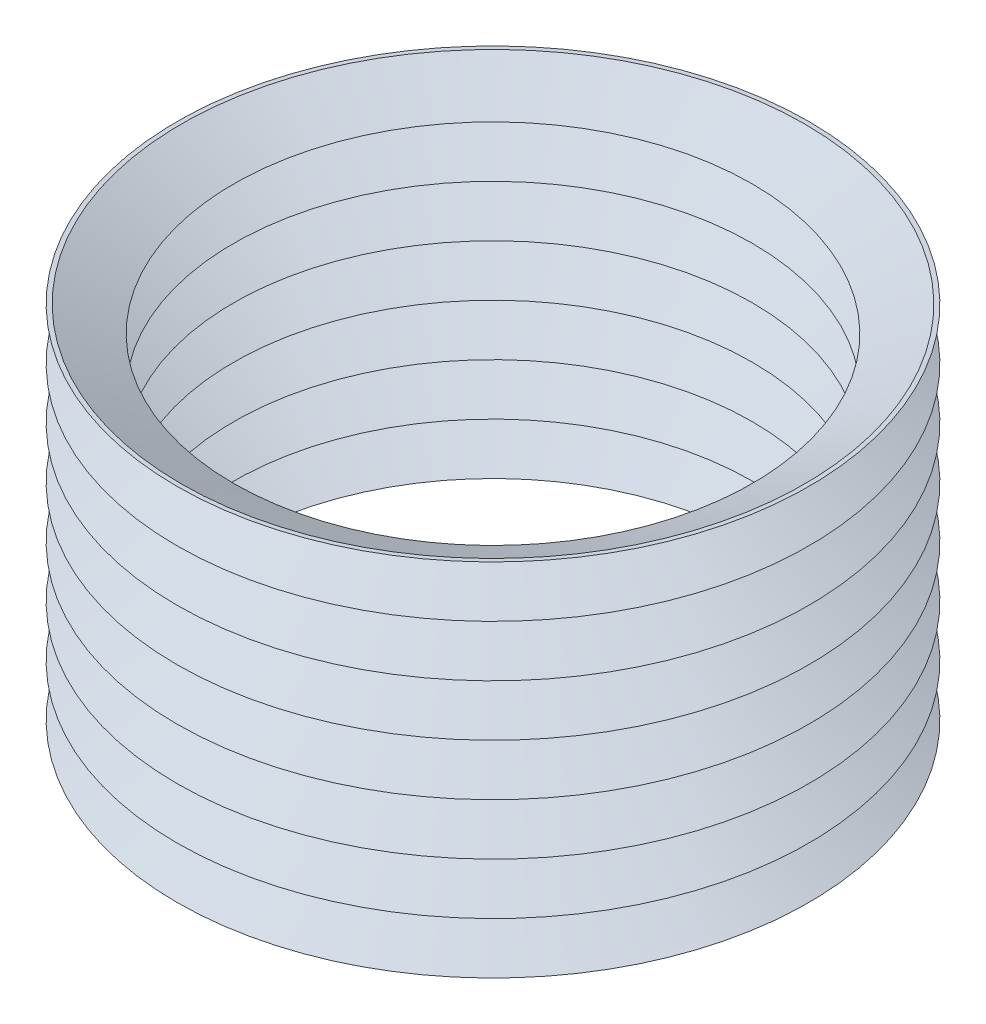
ISO-10303-21;
HEADER;
FILE_DESCRIPTION(('STEP AP214'),'2;1');
FILE_NAME('part.step','',(''),(''),'','','');
FILE_SCHEMA(('AUTOMOTIVE_DESIGN { 1 0 10303 214 1 1 1 1 }'));
ENDSEC;
DATA;
#1=APPLICATION_CONTEXT('core data for automotive mechanical design processes');
#2=APPLICATION_PROTOCOL_DEFINITION('international standard','automotive_design',2000,#1);
#3=PRODUCT_CONTEXT('',#1,'mechanical');
#4=PRODUCT('Part','Part','',(#3));
#5=PRODUCT_RELATED_PRODUCT_CATEGORY('part','',(#4));
#6=PRODUCT_DEFINITION_FORMATION('','',#4);
#7=PRODUCT_DEFINITION_CONTEXT('part definition',#1,'design');
#8=PRODUCT_DEFINITION('design','',#6,#7);
#9=PRODUCT_DEFINITION_SHAPE('','',#8);
#10=(LENGTH_UNIT() NAMED_UNIT(*) SI_UNIT(.MILLI.,.METRE.));
#11=(NAMED_UNIT(*) PLANE_ANGLE_UNIT() SI_UNIT($,.RADIAN.));
#12=(NAMED_UNIT(*) SI_UNIT($,.STERADIAN.) SOLID_ANGLE_UNIT());
#13=UNCERTAINTY_MEASURE_WITH_UNIT(LENGTH_MEASURE(1.E-05),#10,'distance_accuracy_value','');
#14=(GEOMETRIC_REPRESENTATION_CONTEXT(3) GLOBAL_UNCERTAINTY_ASSIGNED_CONTEXT((#13)) GLOBAL_UNIT_ASSIGNED_CONTEXT((#10,
#11,#12)) REPRESENTATION_CONTEXT('',''));
#15=CARTESIAN_POINT('',(0.,0.,0.));
#16=DIRECTION('',(0.,0.,1.));
#17=DIRECTION('',(1.,0.,0.));
#18=AXIS2_PLACEMENT_3D('',#15,#16,#17);
#19=CARTESIAN_POINT('',(0.,78.2,0.));
#20=DIRECTION('',(0.,1.,0.));
#21=DIRECTION('',(0.,0.,1.));
#22=AXIS2_PLACEMENT_3D('',#19,#20,#21);
#23=CONICAL_SURFACE('',#22,33.0468928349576,1.11364172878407);
#24=CARTESIAN_POINT('',(0.,78.2,0.));
#25=DIRECTION('',(0.,1.,0.));
#26=DIRECTION('',(0.,0.,1.));
#27=AXIS2_PLACEMENT_3D('',#24,#25,#26);
#28=CIRCLE('',#27,33.0468928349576);
#29=CARTESIAN_POINT('',(0.,78.2,33.0468928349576));
#30=VERTEX_POINT('',#29);
#31=EDGE_CURVE('E18',#30,#30,#28,.F.);
#32=ORIENTED_EDGE('',*,*,#31,.F.);
#33=EDGE_LOOP('',(#32));
#34=FACE_BOUND('',#33,.T.);
#35=CARTESIAN_POINT('',(0.,75.471428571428,0.));
#36=DIRECTION('',(0.,-1.,0.));
#37=DIRECTION('',(0.,0.,-1.));
#38=AXIS2_PLACEMENT_3D('',#35,#36,#37);
#39=CIRCLE('',#38,27.5);
#40=CARTESIAN_POINT('',(0.,75.471428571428,-27.5));
#41=VERTEX_POINT('',#40);
#42=EDGE_CURVE('E31',#41,#41,#39,.T.);
#43=ORIENTED_EDGE('',*,*,#42,.T.);
#44=EDGE_LOOP('',(#43));
#45=FACE_BOUND('',#44,.T.);
#46=ADVANCED_FACE('F15',(#34,#45),#23,.F.);
#47=CARTESIAN_POINT('',(33.0468928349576,78.2,0.));
#48=DIRECTION('',(0.,1.,0.));
#49=DIRECTION('',(0.,0.,1.));
#50=AXIS2_PLACEMENT_3D('',#47,#48,#49);
#51=PLANE('',#50);
#52=CARTESIAN_POINT('',(0.,78.2,0.));
#53=DIRECTION('',(0.,1.,0.));
#54=DIRECTION('',(0.,0.,1.));
#55=AXIS2_PLACEMENT_3D('',#52,#53,#54);
#56=CIRCLE('',#55,33.5);
#57=CARTESIAN_POINT('',(0.,78.2,33.5));
#58=VERTEX_POINT('',#57);
#59=EDGE_CURVE('E35',#58,#58,#56,.F.);
#60=ORIENTED_EDGE('',*,*,#59,.F.);
#61=EDGE_LOOP('',(#60));
#62=FACE_BOUND('',#61,.T.);
#63=ORIENTED_EDGE('',*,*,#31,.T.);
#64=EDGE_LOOP('',(#63));
#65=FACE_BOUND('',#64,.T.);
#66=ADVANCED_FACE('F48',(#62,#65),#51,.T.);
#67=CARTESIAN_POINT('',(0.,72.742857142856,0.));
#68=DIRECTION('',(0.,-1.,0.));
#69=DIRECTION('',(1.,0.,0.));
#70=AXIS2_PLACEMENT_3D('',#67,#68,#69);
#71=CONICAL_SURFACE('',#70,33.0468928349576,1.11364172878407);
#72=CARTESIAN_POINT('',(0.,72.742857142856,0.));
#73=DIRECTION('',(0.,1.,0.));
#74=DIRECTION('',(0.,0.,1.));
#75=AXIS2_PLACEMENT_3D('',#72,#73,#74);
#76=CIRCLE('',#75,33.0468928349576);
#77=CARTESIAN_POINT('',(0.,72.742857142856,33.0468928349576));
#78=VERTEX_POINT('',#77);
#79=EDGE_CURVE('E37',#78,#78,#76,.F.);
#80=ORIENTED_EDGE('',*,*,#79,.T.);
#81=EDGE_LOOP('',(#80));
#82=FACE_BOUND('',#81,.T.);
#83=ORIENTED_EDGE('',*,*,#42,.F.);
#84=EDGE_LOOP('',(#83));
#85=FACE_BOUND('',#84,.T.);
#86=ADVANCED_FACE('F55',(#82,#85),#71,.F.);
#87=CARTESIAN_POINT('',(0.,78.2,0.));
#88=DIRECTION('',(0.,1.,0.));
#89=DIRECTION('',(0.,0.,1.));
#90=AXIS2_PLACEMENT_3D('',#87,#88,#89);
#91=CONICAL_SURFACE('',#90,33.5,1.11364172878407);
#92=ORIENTED_EDGE('',*,*,#59,.T.);
#93=EDGE_LOOP('',(#92));
#94=FACE_BOUND('',#93,.T.);
#95=CARTESIAN_POINT('',(0.,75.471428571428,0.));
#96=DIRECTION('',(0.,-1.,0.));
#97=DIRECTION('',(0.,0.,-1.));
#98=AXIS2_PLACEMENT_3D('',#95,#96,#97);
#99=CIRCLE('',#98,27.9531071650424);
#100=CARTESIAN_POINT('',(0.,75.471428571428,-27.9531071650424));
#101=VERTEX_POINT('',#100);
#102=EDGE_CURVE('E41',#101,#101,#99,.T.);
#103=ORIENTED_EDGE('',*,*,#102,.F.);
#104=EDGE_LOOP('',(#103));
#105=FACE_BOUND('',#104,.T.);
#106=ADVANCED_FACE('F163',(#94,#105),#91,.T.);
#107=CARTESIAN_POINT('',(0.,72.742857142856,0.));
#108=DIRECTION('',(0.,1.,0.));
#109=DIRECTION('',(-1.,0.,0.));
#110=AXIS2_PLACEMENT_3D('',#107,#108,#109);
#111=CONICAL_SURFACE('',#110,33.0468928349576,1.11364172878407);
#112=ORIENTED_EDGE('',*,*,#79,.F.);
#113=EDGE_LOOP('',(#112));
#114=FACE_BOUND('',#113,.T.);
#115=CARTESIAN_POINT('',(0.,70.0142857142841,0.));
#116=DIRECTION('',(0.,-1.,0.));
#117=DIRECTION('',(0.,0.,-1.));
#118=AXIS2_PLACEMENT_3D('',#115,#116,#117);
#119=CIRCLE('',#118,27.5);
#120=CARTESIAN_POINT('',(0.,70.0142857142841,-27.5));
#121=VERTEX_POINT('',#120);
#122=EDGE_CURVE('E176',#121,#121,#119,.T.);
#123=ORIENTED_EDGE('',*,*,#122,.T.);
#124=EDGE_LOOP('',(#123));
#125=FACE_BOUND('',#124,.T.);
#126=ADVANCED_FACE('F159',(#114,#125),#111,.F.);
#127=CARTESIAN_POINT('',(0.,72.742857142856,0.));
#128=DIRECTION('',(0.,-1.,0.));
#129=DIRECTION('',(1.,0.,0.));
#130=AXIS2_PLACEMENT_3D('',#127,#128,#129);
#131=CONICAL_SURFACE('',#130,33.5,1.11364172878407);
#132=CARTESIAN_POINT('',(0.,72.742857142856,0.));
#133=DIRECTION('',(0.,1.,0.));
#134=DIRECTION('',(0.,0.,1.));
#135=AXIS2_PLACEMENT_3D('',#132,#133,#134);
#136=CIRCLE('',#135,33.5);
#137=CARTESIAN_POINT('',(0.,72.742857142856,33.5));
#138=VERTEX_POINT('',#137);
#139=EDGE_CURVE('E178',#138,#138,#136,.F.);
#140=ORIENTED_EDGE('',*,*,#139,.F.);
#141=EDGE_LOOP('',(#140));
#142=FACE_BOUND('',#141,.T.);
#143=ORIENTED_EDGE('',*,*,#102,.T.);
#144=EDGE_LOOP('',(#143));
#145=FACE_BOUND('',#144,.T.);
#146=ADVANCED_FACE('F155',(#142,#145),#131,.T.);
#147=CARTESIAN_POINT('',(0.,67.2857142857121,0.));
#148=DIRECTION('',(0.,-1.,0.));
#149=DIRECTION('',(0.,0.,-1.));
#150=AXIS2_PLACEMENT_3D('',#147,#148,#149);
#151=CONICAL_SURFACE('',#150,33.0468928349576,1.11364172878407);
#152=CARTESIAN_POINT('',(0.,67.2857142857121,0.));
#153=DIRECTION('',(0.,1.,0.));
#154=DIRECTION('',(0.,0.,1.));
#155=AXIS2_PLACEMENT_3D('',#152,#153,#154);
#156=CIRCLE('',#155,33.0468928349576);
#157=CARTESIAN_POINT('',(0.,67.2857142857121,33.0468928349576));
#158=VERTEX_POINT('',#157);
#159=EDGE_CURVE('E181',#158,#158,#156,.F.);
#160=ORIENTED_EDGE('',*,*,#159,.T.);
#161=EDGE_LOOP('',(#160));
#162=FACE_BOUND('',#161,.T.);
#163=ORIENTED_EDGE('',*,*,#122,.F.);
#164=EDGE_LOOP('',(#163));
#165=FACE_BOUND('',#164,.T.);
#166=ADVANCED_FACE('F151',(#162,#165),#151,.F.);
#167=CARTESIAN_POINT('',(0.,72.742857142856,0.));
#168=DIRECTION('',(0.,1.,0.));
#169=DIRECTION('',(-1.,0.,0.));
#170=AXIS2_PLACEMENT_3D('',#167,#168,#169);
#171=CONICAL_SURFACE('',#170,33.5,1.11364172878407);
#172=ORIENTED_EDGE('',*,*,#139,.T.);
#173=EDGE_LOOP('',(#172));
#174=FACE_BOUND('',#173,.T.);
#175=CARTESIAN_POINT('',(0.,70.0142857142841,0.));
#176=DIRECTION('',(0.,-1.,0.));
#177=DIRECTION('',(0.,0.,-1.));
#178=AXIS2_PLACEMENT_3D('',#175,#176,#177);
#179=CIRCLE('',#178,27.9531071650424);
#180=CARTESIAN_POINT('',(0.,70.0142857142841,-27.9531071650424));
#181=VERTEX_POINT('',#180);
#182=EDGE_CURVE('E188',#181,#181,#179,.T.);
#183=ORIENTED_EDGE('',*,*,#182,.F.);
#184=EDGE_LOOP('',(#183));
#185=FACE_BOUND('',#184,.T.);
#186=ADVANCED_FACE('F147',(#174,#185),#171,.T.);
#187=CARTESIAN_POINT('',(0.,67.2857142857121,0.));
#188=DIRECTION('',(0.,1.,0.));
#189=DIRECTION('',(0.,0.,1.));
#190=AXIS2_PLACEMENT_3D('',#187,#188,#189);
#191=CONICAL_SURFACE('',#190,33.0468928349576,1.11364172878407);
#192=ORIENTED_EDGE('',*,*,#159,.F.);
#193=EDGE_LOOP('',(#192));
#194=FACE_BOUND('',#193,.T.);
#195=CARTESIAN_POINT('',(0.,64.5571428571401,0.));
#196=DIRECTION('',(0.,-1.,0.));
#197=DIRECTION('',(0.,0.,-1.));
#198=AXIS2_PLACEMENT_3D('',#195,#196,#197);
#199=CIRCLE('',#198,27.5);
#200=CARTESIAN_POINT('',(0.,64.5571428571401,-27.5));
#201=VERTEX_POINT('',#200);
#202=EDGE_CURVE('E191',#201,#201,#199,.T.);
#203=ORIENTED_EDGE('',*,*,#202,.T.);
#204=EDGE_LOOP('',(#203));
#205=FACE_BOUND('',#204,.T.);
#206=ADVANCED_FACE('F143',(#194,#205),#191,.F.);
#207=CARTESIAN_POINT('',(0.,67.2857142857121,0.));
#208=DIRECTION('',(0.,-1.,0.));
#209=DIRECTION('',(0.,0.,-1.));
#210=AXIS2_PLACEMENT_3D('',#207,#208,#209);
#211=CONICAL_SURFACE('',#210,33.5,1.11364172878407);
#212=CARTESIAN_POINT('',(0.,67.2857142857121,0.));
#213=DIRECTION('',(0.,1.,0.));
#214=DIRECTION('',(0.,0.,1.));
#215=AXIS2_PLACEMENT_3D('',#212,#213,#214);
#216=CIRCLE('',#215,33.5);
#217=CARTESIAN_POINT('',(0.,67.2857142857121,33.5));
#218=VERTEX_POINT('',#217);
#219=EDGE_CURVE('E194',#218,#218,#216,.F.);
#220=ORIENTED_EDGE('',*,*,#219,.F.);
#221=EDGE_LOOP('',(#220));
#222=FACE_BOUND('',#221,.T.);
#223=ORIENTED_EDGE('',*,*,#182,.T.);
#224=EDGE_LOOP('',(#223));
#225=FACE_BOUND('',#224,.T.);
#226=ADVANCED_FACE('F139',(#222,#225),#211,.T.);
#227=CARTESIAN_POINT('',(0.,61.8285714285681,0.));
#228=DIRECTION('',(0.,-1.,0.));
#229=DIRECTION('',(0.,0.,-1.));
#230=AXIS2_PLACEMENT_3D('',#227,#228,#229);
#231=CONICAL_SURFACE('',#230,33.0468928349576,1.11364172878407);
#232=CARTESIAN_POINT('',(0.,61.8285714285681,0.));
#233=DIRECTION('',(0.,1.,0.));
#234=DIRECTION('',(0.,0.,1.));
#235=AXIS2_PLACEMENT_3D('',#232,#233,#234);
#236=CIRCLE('',#235,33.0468928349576);
#237=CARTESIAN_POINT('',(0.,61.8285714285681,33.0468928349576));
#238=VERTEX_POINT('',#237);
#239=EDGE_CURVE('E197',#238,#238,#236,.F.);
#240=ORIENTED_EDGE('',*,*,#239,.T.);
#241=EDGE_LOOP('',(#240));
#242=FACE_BOUND('',#241,.T.);
#243=ORIENTED_EDGE('',*,*,#202,.F.);
#244=EDGE_LOOP('',(#243));
#245=FACE_BOUND('',#244,.T.);
#246=ADVANCED_FACE('F135',(#242,#245),#231,.F.);
#247=CARTESIAN_POINT('',(0.,67.2857142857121,0.));
#248=DIRECTION('',(0.,1.,0.));
#249=DIRECTION('',(0.,0.,1.));
#250=AXIS2_PLACEMENT_3D('',#247,#248,#249);
#251=CONICAL_SURFACE('',#250,33.5,1.11364172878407);
#252=ORIENTED_EDGE('',*,*,#219,.T.);
#253=EDGE_LOOP('',(#252));
#254=FACE_BOUND('',#253,.T.);
#255=CARTESIAN_POINT('',(0.,64.5571428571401,0.));
#256=DIRECTION('',(0.,-1.,0.));
#257=DIRECTION('',(0.,0.,-1.));
#258=AXIS2_PLACEMENT_3D('',#255,#256,#257);
#259=CIRCLE('',#258,27.9531071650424);
#260=CARTESIAN_POINT('',(0.,64.5571428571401,-27.9531071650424));
#261=VERTEX_POINT('',#260);
#262=EDGE_CURVE('E200',#261,#261,#259,.T.);
#263=ORIENTED_EDGE('',*,*,#262,.F.);
#264=EDGE_LOOP('',(#263));
#265=FACE_BOUND('',#264,.T.);
#266=ADVANCED_FACE('F131',(#254,#265),#251,.T.);
#267=CARTESIAN_POINT('',(0.,61.8285714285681,0.));
#268=DIRECTION('',(0.,1.,0.));
#269=DIRECTION('',(0.,0.,1.));
#270=AXIS2_PLACEMENT_3D('',#267,#268,#269);
#271=CONICAL_SURFACE('',#270,33.0468928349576,1.11364172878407);
#272=ORIENTED_EDGE('',*,*,#239,.F.);
#273=EDGE_LOOP('',(#272));
#274=FACE_BOUND('',#273,.T.);
#275=CARTESIAN_POINT('',(0.,59.0999999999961,0.));
#276=DIRECTION('',(0.,-1.,0.));
#277=DIRECTION('',(0.,0.,-1.));
#278=AXIS2_PLACEMENT_3D('',#275,#276,#277);
#279=CIRCLE('',#278,27.5);
#280=CARTESIAN_POINT('',(0.,59.0999999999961,-27.5));
#281=VERTEX_POINT('',#280);
#282=EDGE_CURVE('E203',#281,#281,#279,.T.);
#283=ORIENTED_EDGE('',*,*,#282,.T.);
#284=EDGE_LOOP('',(#283));
#285=FACE_BOUND('',#284,.T.);
#286=ADVANCED_FACE('F127',(#274,#285),#271,.F.);
#287=CARTESIAN_POINT('',(0.,61.8285714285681,0.));
#288=DIRECTION('',(0.,-1.,0.));
#289=DIRECTION('',(1.,0.,0.));
#290=AXIS2_PLACEMENT_3D('',#287,#288,#289);
#291=CONICAL_SURFACE('',#290,33.5,1.11364172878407);
#292=CARTESIAN_POINT('',(0.,61.8285714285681,0.));
#293=DIRECTION('',(0.,1.,0.));
#294=DIRECTION('',(0.,0.,1.));
#295=AXIS2_PLACEMENT_3D('',#292,#293,#294);
#296=CIRCLE('',#295,33.5);
#297=CARTESIAN_POINT('',(0.,61.8285714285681,33.5));
#298=VERTEX_POINT('',#297);
#299=EDGE_CURVE('E206',#298,#298,#296,.F.);
#300=ORIENTED_EDGE('',*,*,#299,.F.);
#301=EDGE_LOOP('',(#300));
#302=FACE_BOUND('',#301,.T.);
#303=ORIENTED_EDGE('',*,*,#262,.T.);
#304=EDGE_LOOP('',(#303));
#305=FACE_BOUND('',#304,.T.);
#306=ADVANCED_FACE('F123',(#302,#305),#291,.T.);
#307=CARTESIAN_POINT('',(0.,56.3714285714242,0.));
#308=DIRECTION('',(0.,-1.,0.));
#309=DIRECTION('',(1.,0.,0.));
#310=AXIS2_PLACEMENT_3D('',#307,#308,#309);
#311=CONICAL_SURFACE('',#310,33.0468928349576,1.11364172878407);
#312=CARTESIAN_POINT('',(0.,56.3714285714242,0.));
#313=DIRECTION('',(0.,1.,0.));
#314=DIRECTION('',(0.,0.,1.));
#315=AXIS2_PLACEMENT_3D('',#312,#313,#314);
#316=CIRCLE('',#315,33.0468928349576);
#317=CARTESIAN_POINT('',(0.,56.3714285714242,33.0468928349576));
#318=VERTEX_POINT('',#317);
#319=EDGE_CURVE('E209',#318,#318,#316,.F.);
#320=ORIENTED_EDGE('',*,*,#319,.T.);
#321=EDGE_LOOP('',(#320));
#322=FACE_BOUND('',#321,.T.);
#323=ORIENTED_EDGE('',*,*,#282,.F.);
#324=EDGE_LOOP('',(#323));
#325=FACE_BOUND('',#324,.T.);
#326=ADVANCED_FACE('F119',(#322,#325),#311,.F.);
#327=CARTESIAN_POINT('',(0.,61.8285714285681,0.));
#328=DIRECTION('',(0.,1.,0.));
#329=DIRECTION('',(-1.,0.,0.));
#330=AXIS2_PLACEMENT_3D('',#327,#328,#329);
#331=CONICAL_SURFACE('',#330,33.5,1.11364172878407);
#332=ORIENTED_EDGE('',*,*,#299,.T.);
#333=EDGE_LOOP('',(#332));
#334=FACE_BOUND('',#333,.T.);
#335=CARTESIAN_POINT('',(0.,59.0999999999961,0.));
#336=DIRECTION('',(0.,-1.,0.));
#337=DIRECTION('',(0.,0.,-1.));
#338=AXIS2_PLACEMENT_3D('',#335,#336,#337);
#339=CIRCLE('',#338,27.9531071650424);
#340=CARTESIAN_POINT('',(0.,59.0999999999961,-27.9531071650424));
#341=VERTEX_POINT('',#340);
#342=EDGE_CURVE('E212',#341,#341,#339,.T.);
#343=ORIENTED_EDGE('',*,*,#342,.F.);
#344=EDGE_LOOP('',(#343));
#345=FACE_BOUND('',#344,.T.);
#346=ADVANCED_FACE('F115',(#334,#345),#331,.T.);
#347=CARTESIAN_POINT('',(0.,56.3714285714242,0.));
#348=DIRECTION('',(0.,1.,0.));
#349=DIRECTION('',(-1.,0.,0.));
#350=AXIS2_PLACEMENT_3D('',#347,#348,#349);
#351=CONICAL_SURFACE('',#350,33.0468928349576,1.11364172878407);
#352=ORIENTED_EDGE('',*,*,#319,.F.);
#353=EDGE_LOOP('',(#352));
#354=FACE_BOUND('',#353,.T.);
#355=CARTESIAN_POINT('',(0.,53.6428571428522,0.));
#356=DIRECTION('',(0.,-1.,0.));
#357=DIRECTION('',(0.,0.,-1.));
#358=AXIS2_PLACEMENT_3D('',#355,#356,#357);
#359=CIRCLE('',#358,27.5);
#360=CARTESIAN_POINT('',(0.,53.6428571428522,-27.5));
#361=VERTEX_POINT('',#360);
#362=EDGE_CURVE('E215',#361,#361,#359,.T.);
#363=ORIENTED_EDGE('',*,*,#362,.T.);
#364=EDGE_LOOP('',(#363));
#365=FACE_BOUND('',#364,.T.);
#366=ADVANCED_FACE('F111',(#354,#365),#351,.F.);
#367=CARTESIAN_POINT('',(0.,56.3714285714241,0.));
#368=DIRECTION('',(0.,-1.,0.));
#369=DIRECTION('',(1.,0.,0.));
#370=AXIS2_PLACEMENT_3D('',#367,#368,#369);
#371=CONICAL_SURFACE('',#370,33.5,1.11364172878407);
#372=CARTESIAN_POINT('',(0.,56.3714285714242,0.));
#373=DIRECTION('',(0.,1.,0.));
#374=DIRECTION('',(0.,0.,1.));
#375=AXIS2_PLACEMENT_3D('',#372,#373,#374);
#376=CIRCLE('',#375,33.5);
#377=CARTESIAN_POINT('',(0.,56.3714285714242,33.5));
#378=VERTEX_POINT('',#377);
#379=EDGE_CURVE('E218',#378,#378,#376,.F.);
#380=ORIENTED_EDGE('',*,*,#379,.F.);
#381=EDGE_LOOP('',(#380));
#382=FACE_BOUND('',#381,.T.);
#383=ORIENTED_EDGE('',*,*,#342,.T.);
#384=EDGE_LOOP('',(#383));
#385=FACE_BOUND('',#384,.T.);
#386=ADVANCED_FACE('F107',(#382,#385),#371,.T.);
#387=CARTESIAN_POINT('',(0.,50.9142857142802,0.));
#388=DIRECTION('',(0.,-1.,0.));
#389=DIRECTION('',(1.,0.,0.));
#390=AXIS2_PLACEMENT_3D('',#387,#388,#389);
#391=CONICAL_SURFACE('',#390,33.0468928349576,1.11364172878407);
#392=CARTESIAN_POINT('',(0.,50.9142857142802,0.));
#393=DIRECTION('',(0.,1.,0.));
#394=DIRECTION('',(0.,0.,1.));
#395=AXIS2_PLACEMENT_3D('',#392,#393,#394);
#396=CIRCLE('',#395,33.0468928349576);
#397=CARTESIAN_POINT('',(0.,50.9142857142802,33.0468928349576));
#398=VERTEX_POINT('',#397);
#399=EDGE_CURVE('E221',#398,#398,#396,.F.);
#400=ORIENTED_EDGE('',*,*,#399,.T.);
#401=EDGE_LOOP('',(#400));
#402=FACE_BOUND('',#401,.T.);
#403=ORIENTED_EDGE('',*,*,#362,.F.);
#404=EDGE_LOOP('',(#403));
#405=FACE_BOUND('',#404,.T.);
#406=ADVANCED_FACE('F103',(#402,#405),#391,.F.);
#407=CARTESIAN_POINT('',(0.,56.3714285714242,0.));
#408=DIRECTION('',(0.,1.,0.));
#409=DIRECTION('',(-1.,0.,0.));
#410=AXIS2_PLACEMENT_3D('',#407,#408,#409);
#411=CONICAL_SURFACE('',#410,33.5,1.11364172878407);
#412=ORIENTED_EDGE('',*,*,#379,.T.);
#413=EDGE_LOOP('',(#412));
#414=FACE_BOUND('',#413,.T.);
#415=CARTESIAN_POINT('',(0.,53.6428571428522,0.));
#416=DIRECTION('',(0.,-1.,0.));
#417=DIRECTION('',(0.,0.,-1.));
#418=AXIS2_PLACEMENT_3D('',#415,#416,#417);
#419=CIRCLE('',#418,27.9531071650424);
#420=CARTESIAN_POINT('',(0.,53.6428571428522,-27.9531071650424));
#421=VERTEX_POINT('',#420);
#422=EDGE_CURVE('E224',#421,#421,#419,.T.);
#423=ORIENTED_EDGE('',*,*,#422,.F.);
#424=EDGE_LOOP('',(#423));
#425=FACE_BOUND('',#424,.T.);
#426=ADVANCED_FACE('F99',(#414,#425),#411,.T.);
#427=CARTESIAN_POINT('',(0.,50.9142857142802,0.));
#428=DIRECTION('',(0.,1.,0.));
#429=DIRECTION('',(-1.,0.,0.));
#430=AXIS2_PLACEMENT_3D('',#427,#428,#429);
#431=CONICAL_SURFACE('',#430,33.0468928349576,1.11364172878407);
#432=ORIENTED_EDGE('',*,*,#399,.F.);
#433=EDGE_LOOP('',(#432));
#434=FACE_BOUND('',#433,.T.);
#435=CARTESIAN_POINT('',(0.,48.1857142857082,0.));
#436=DIRECTION('',(0.,-1.,0.));
#437=DIRECTION('',(0.,0.,-1.));
#438=AXIS2_PLACEMENT_3D('',#435,#436,#437);
#439=CIRCLE('',#438,27.5);
#440=CARTESIAN_POINT('',(0.,48.1857142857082,-27.5));
#441=VERTEX_POINT('',#440);
#442=EDGE_CURVE('E227',#441,#441,#439,.T.);
#443=ORIENTED_EDGE('',*,*,#442,.T.);
#444=EDGE_LOOP('',(#443));
#445=FACE_BOUND('',#444,.T.);
#446=ADVANCED_FACE('F95',(#434,#445),#431,.F.);
#447=CARTESIAN_POINT('',(0.,50.9142857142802,0.));
#448=DIRECTION('',(0.,-1.,0.));
#449=DIRECTION('',(1.,0.,0.));
#450=AXIS2_PLACEMENT_3D('',#447,#448,#449);
#451=CONICAL_SURFACE('',#450,33.5,1.11364172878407);
#452=CARTESIAN_POINT('',(0.,50.9142857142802,0.));
#453=DIRECTION('',(0.,1.,0.));
#454=DIRECTION('',(0.,0.,1.));
#455=AXIS2_PLACEMENT_3D('',#452,#453,#454);
#456=CIRCLE('',#455,33.5);
#457=CARTESIAN_POINT('',(0.,50.9142857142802,33.5));
#458=VERTEX_POINT('',#457);
#459=EDGE_CURVE('E230',#458,#458,#456,.F.);
#460=ORIENTED_EDGE('',*,*,#459,.F.);
#461=EDGE_LOOP('',(#460));
#462=FACE_BOUND('',#461,.T.);
#463=ORIENTED_EDGE('',*,*,#422,.T.);
#464=EDGE_LOOP('',(#463));
#465=FACE_BOUND('',#464,.T.);
#466=ADVANCED_FACE('F91',(#462,#465),#451,.T.);
#467=CARTESIAN_POINT('',(0.,45.4571428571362,0.));
#468=DIRECTION('',(0.,-1.,0.));
#469=DIRECTION('',(0.,0.,-1.));
#470=AXIS2_PLACEMENT_3D('',#467,#468,#469);
#471=CONICAL_SURFACE('',#470,33.0468928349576,1.11364172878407);
#472=CARTESIAN_POINT('',(0.,45.4571428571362,0.));
#473=DIRECTION('',(0.,1.,0.));
#474=DIRECTION('',(0.,0.,1.));
#475=AXIS2_PLACEMENT_3D('',#472,#473,#474);
#476=CIRCLE('',#475,33.0468928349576);
#477=CARTESIAN_POINT('',(0.,45.4571428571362,33.0468928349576));
#478=VERTEX_POINT('',#477);
#479=EDGE_CURVE('E233',#478,#478,#476,.F.);
#480=ORIENTED_EDGE('',*,*,#479,.T.);
#481=EDGE_LOOP('',(#480));
#482=FACE_BOUND('',#481,.T.);
#483=ORIENTED_EDGE('',*,*,#442,.F.);
#484=EDGE_LOOP('',(#483));
#485=FACE_BOUND('',#484,.T.);
#486=ADVANCED_FACE('F87',(#482,#485),#471,.F.);
#487=CARTESIAN_POINT('',(0.,50.9142857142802,0.));
#488=DIRECTION('',(0.,1.,0.));
#489=DIRECTION('',(0.,0.,1.));
#490=AXIS2_PLACEMENT_3D('',#487,#488,#489);
#491=CONICAL_SURFACE('',#490,33.5,1.11364172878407);
#492=ORIENTED_EDGE('',*,*,#459,.T.);
#493=EDGE_LOOP('',(#492));
#494=FACE_BOUND('',#493,.T.);
#495=CARTESIAN_POINT('',(0.,48.1857142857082,0.));
#496=DIRECTION('',(0.,-1.,0.));
#497=DIRECTION('',(0.,0.,-1.));
#498=AXIS2_PLACEMENT_3D('',#495,#496,#497);
#499=CIRCLE('',#498,27.9531071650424);
#500=CARTESIAN_POINT('',(0.,48.1857142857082,-27.9531071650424));
#501=VERTEX_POINT('',#500);
#502=EDGE_CURVE('E236',#501,#501,#499,.T.);
#503=ORIENTED_EDGE('',*,*,#502,.F.);
#504=EDGE_LOOP('',(#503));
#505=FACE_BOUND('',#504,.T.);
#506=ADVANCED_FACE('F83',(#494,#505),#491,.T.);
#507=CARTESIAN_POINT('',(0.,45.4571428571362,0.));
#508=DIRECTION('',(0.,1.,0.));
#509=DIRECTION('',(0.,0.,1.));
#510=AXIS2_PLACEMENT_3D('',#507,#508,#509);
#511=CONICAL_SURFACE('',#510,33.0468928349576,1.11364172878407);
#512=ORIENTED_EDGE('',*,*,#479,.F.);
#513=EDGE_LOOP('',(#512));
#514=FACE_BOUND('',#513,.T.);
#515=CARTESIAN_POINT('',(0.,42.7285714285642,0.));
#516=DIRECTION('',(0.,-1.,0.));
#517=DIRECTION('',(0.,0.,-1.));
#518=AXIS2_PLACEMENT_3D('',#515,#516,#517);
#519=CIRCLE('',#518,27.5);
#520=CARTESIAN_POINT('',(0.,42.7285714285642,-27.5));
#521=VERTEX_POINT('',#520);
#522=EDGE_CURVE('E239',#521,#521,#519,.T.);
#523=ORIENTED_EDGE('',*,*,#522,.T.);
#524=EDGE_LOOP('',(#523));
#525=FACE_BOUND('',#524,.T.);
#526=ADVANCED_FACE('F79',(#514,#525),#511,.F.);
#527=CARTESIAN_POINT('',(0.,45.4571428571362,0.));
#528=DIRECTION('',(0.,-1.,0.));
#529=DIRECTION('',(0.,0.,-1.));
#530=AXIS2_PLACEMENT_3D('',#527,#528,#529);
#531=CONICAL_SURFACE('',#530,33.5,1.11364172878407);
#532=CARTESIAN_POINT('',(0.,45.4571428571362,0.));
#533=DIRECTION('',(0.,1.,0.));
#534=DIRECTION('',(0.,0.,1.));
#535=AXIS2_PLACEMENT_3D('',#532,#533,#534);
#536=CIRCLE('',#535,33.5);
#537=CARTESIAN_POINT('',(0.,45.4571428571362,33.5));
#538=VERTEX_POINT('',#537);
#539=EDGE_CURVE('E34',#538,#538,#536,.F.);
#540=ORIENTED_EDGE('',*,*,#539,.F.);
#541=EDGE_LOOP('',(#540));
#542=FACE_BOUND('',#541,.T.);
#543=ORIENTED_EDGE('',*,*,#502,.T.);
#544=EDGE_LOOP('',(#543));
#545=FACE_BOUND('',#544,.T.);
#546=ADVANCED_FACE('F75',(#542,#545),#531,.T.);
#547=CARTESIAN_POINT('',(0.,39.9999999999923,0.));
#548=DIRECTION('',(0.,-1.,0.));
#549=DIRECTION('',(0.,0.,-1.));
#550=AXIS2_PLACEMENT_3D('',#547,#548,#549);
#551=CONICAL_SURFACE('',#550,33.0468928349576,1.11364172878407);
#552=CARTESIAN_POINT('',(0.,39.9999999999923,0.));
#553=DIRECTION('',(0.,-1.,0.));
#554=DIRECTION('',(0.,0.,-1.));
#555=AXIS2_PLACEMENT_3D('',#552,#553,#554);
#556=CIRCLE('',#555,33.0468928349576);
#557=CARTESIAN_POINT('',(0.,39.9999999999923,-33.0468928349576));
#558=VERTEX_POINT('',#557);
#559=EDGE_CURVE('E27',#558,#558,#556,.F.);
#560=ORIENTED_EDGE('',*,*,#559,.F.);
#561=EDGE_LOOP('',(#560));
#562=FACE_BOUND('',#561,.T.);
#563=ORIENTED_EDGE('',*,*,#522,.F.);
#564=EDGE_LOOP('',(#563));
#565=FACE_BOUND('',#564,.T.);
#566=ADVANCED_FACE('F71',(#562,#565),#551,.F.);
#567=CARTESIAN_POINT('',(0.,45.4571428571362,0.));
#568=DIRECTION('',(0.,1.,0.));
#569=DIRECTION('',(0.,0.,1.));
#570=AXIS2_PLACEMENT_3D('',#567,#568,#569);
#571=CONICAL_SURFACE('',#570,33.5,1.11364172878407);
#572=ORIENTED_EDGE('',*,*,#539,.T.);
#573=EDGE_LOOP('',(#572));
#574=FACE_BOUND('',#573,.T.);
#575=CARTESIAN_POINT('',(0.,42.7285714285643,0.));
#576=DIRECTION('',(0.,-1.,0.));
#577=DIRECTION('',(0.,0.,-1.));
#578=AXIS2_PLACEMENT_3D('',#575,#576,#577);
#579=CIRCLE('',#578,27.9531071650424);
#580=CARTESIAN_POINT('',(0.,42.7285714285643,-27.9531071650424));
#581=VERTEX_POINT('',#580);
#582=EDGE_CURVE('E22',#581,#581,#579,.T.);
#583=ORIENTED_EDGE('',*,*,#582,.F.);
#584=EDGE_LOOP('',(#583));
#585=FACE_BOUND('',#584,.T.);
#586=ADVANCED_FACE('F64',(#574,#585),#571,.T.);
#587=CARTESIAN_POINT('',(33.5,39.9999999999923,0.));
#588=DIRECTION('',(0.,-1.,0.));
#589=DIRECTION('',(0.,0.,-1.));
#590=AXIS2_PLACEMENT_3D('',#587,#588,#589);
#591=PLANE('',#590);
#592=ORIENTED_EDGE('',*,*,#559,.T.);
#593=EDGE_LOOP('',(#592));
#594=FACE_BOUND('',#593,.T.);
#595=CARTESIAN_POINT('',(0.,39.9999999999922,0.));
#596=DIRECTION('',(0.,-1.,0.));
#597=DIRECTION('',(0.,0.,-1.));
#598=AXIS2_PLACEMENT_3D('',#595,#596,#597);
#599=CIRCLE('',#598,33.5);
#600=CARTESIAN_POINT('',(0.,39.9999999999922,-33.5));
#601=VERTEX_POINT('',#600);
#602=EDGE_CURVE('E10',#601,#601,#599,.F.);
#603=ORIENTED_EDGE('',*,*,#602,.F.);
#604=EDGE_LOOP('',(#603));
#605=FACE_BOUND('',#604,.T.);
#606=ADVANCED_FACE('F59',(#594,#605),#591,.T.);
#607=CARTESIAN_POINT('',(0.,39.9999999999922,0.));
#608=DIRECTION('',(0.,-1.,0.));
#609=DIRECTION('',(0.,0.,-1.));
#610=AXIS2_PLACEMENT_3D('',#607,#608,#609);
#611=CONICAL_SURFACE('',#610,33.5,1.11364172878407);
#612=ORIENTED_EDGE('',*,*,#602,.T.);
#613=EDGE_LOOP('',(#612));
#614=FACE_BOUND('',#613,.T.);
#615=ORIENTED_EDGE('',*,*,#582,.T.);
#616=EDGE_LOOP('',(#615));
#617=FACE_BOUND('',#616,.T.);
#618=ADVANCED_FACE('F57',(#614,#617),#611,.T.);
#619=CLOSED_SHELL('',(#46,#66,#86,#106,#126,#146,#166,#186,#206,#226,#246,#266,#286,#306,#326,
#346,#366,#386,#406,#426,#446,#466,#486,#506,#526,#546,#566,#586,#606,#618));
#620=MANIFOLD_SOLID_BREP('B1',#619);
#621=ADVANCED_BREP_SHAPE_REPRESENTATION('',(#18,#620),#14);
#622=SHAPE_DEFINITION_REPRESENTATION(#9,#621);
ENDSEC;
END-ISO-10303-21;
